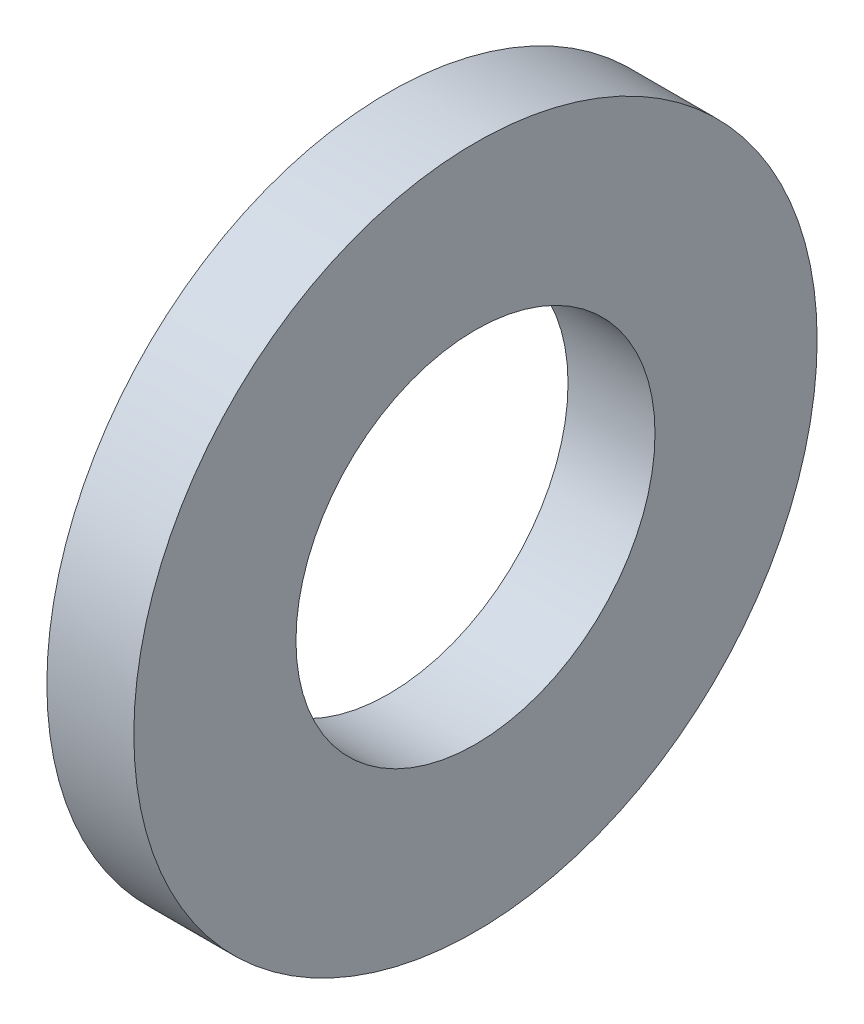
from build123d import *

# Parameters (mm, degrees)
SKETCH1_W = 1.4
SKETCH1_H = 2.61


with BuildPart() as part:
    # Sketch1 → Base-Revolve (revolve)
    with BuildSketch(Plane.XY, mode=Mode.PRIVATE) as base_revolve_sk:
        with Locations((-0.7, 4.195)):
            Rectangle(SKETCH1_W, SKETCH1_H)
    revolve(base_revolve_sk.sketch.rotate(Axis((-34.925, 0, 0), (1, 0, 0)), 90), axis=Axis((-34.925, 0, 0), (1, 0, 0)))


solid = part.part
